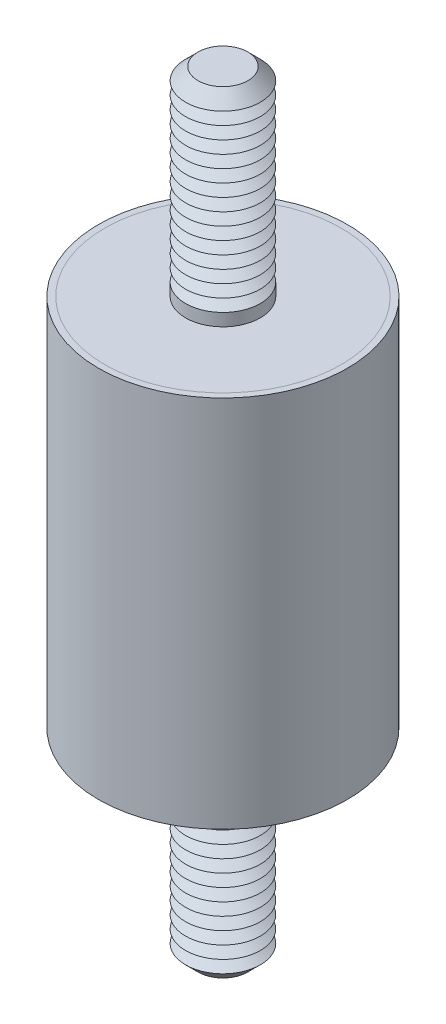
ISO-10303-21;
HEADER;
FILE_DESCRIPTION(('STEP AP214'),'2;1');
FILE_NAME('part.step','',(''),(''),'','','');
FILE_SCHEMA(('AUTOMOTIVE_DESIGN { 1 0 10303 214 1 1 1 1 }'));
ENDSEC;
DATA;
#1=APPLICATION_CONTEXT('core data for automotive mechanical design processes');
#2=APPLICATION_PROTOCOL_DEFINITION('international standard','automotive_design',2000,#1);
#3=PRODUCT_CONTEXT('',#1,'mechanical');
#4=PRODUCT('Part','Part','',(#3));
#5=PRODUCT_RELATED_PRODUCT_CATEGORY('part','',(#4));
#6=PRODUCT_DEFINITION_FORMATION('','',#4);
#7=PRODUCT_DEFINITION_CONTEXT('part definition',#1,'design');
#8=PRODUCT_DEFINITION('design','',#6,#7);
#9=PRODUCT_DEFINITION_SHAPE('','',#8);
#10=(LENGTH_UNIT() NAMED_UNIT(*) SI_UNIT(.MILLI.,.METRE.));
#11=(NAMED_UNIT(*) PLANE_ANGLE_UNIT() SI_UNIT($,.RADIAN.));
#12=(NAMED_UNIT(*) SI_UNIT($,.STERADIAN.) SOLID_ANGLE_UNIT());
#13=UNCERTAINTY_MEASURE_WITH_UNIT(LENGTH_MEASURE(1.E-05),#10,'distance_accuracy_value','');
#14=(GEOMETRIC_REPRESENTATION_CONTEXT(3) GLOBAL_UNCERTAINTY_ASSIGNED_CONTEXT((#13)) GLOBAL_UNIT_ASSIGNED_CONTEXT((#10,
#11,#12)) REPRESENTATION_CONTEXT('',''));
#15=CARTESIAN_POINT('',(0.,0.,0.));
#16=DIRECTION('',(0.,0.,1.));
#17=DIRECTION('',(1.,0.,0.));
#18=AXIS2_PLACEMENT_3D('',#15,#16,#17);
#19=CARTESIAN_POINT('',(0.,-31.,0.));
#20=DIRECTION('',(0.,1.,0.));
#21=DIRECTION('',(0.,0.,1.));
#22=AXIS2_PLACEMENT_3D('',#19,#20,#21);
#23=CYLINDRICAL_SURFACE('',#22,3.);
#24=CARTESIAN_POINT('',(0.,-15.,0.));
#25=DIRECTION('',(0.,-1.,0.));
#26=DIRECTION('',(0.,0.,-1.));
#27=AXIS2_PLACEMENT_3D('',#24,#25,#26);
#28=CIRCLE('',#27,3.);
#29=CARTESIAN_POINT('',(0.,-15.,-3.));
#30=VERTEX_POINT('',#29);
#31=EDGE_CURVE('P0_E21',#30,#30,#28,.T.);
#32=ORIENTED_EDGE('',*,*,#31,.T.);
#33=EDGE_LOOP('',(#32));
#34=FACE_BOUND('',#33,.T.);
#35=CARTESIAN_POINT('',(0.,-16.,0.));
#36=DIRECTION('',(0.,1.,0.));
#37=DIRECTION('',(0.,0.,1.));
#38=AXIS2_PLACEMENT_3D('',#35,#36,#37);
#39=CIRCLE('',#38,3.);
#40=CARTESIAN_POINT('',(0.,-16.,3.));
#41=VERTEX_POINT('',#40);
#42=EDGE_CURVE('P0_E33',#41,#41,#39,.T.);
#43=ORIENTED_EDGE('',*,*,#42,.T.);
#44=EDGE_LOOP('',(#43));
#45=FACE_BOUND('',#44,.T.);
#46=ADVANCED_FACE('P0_F14',(#34,#45),#23,.T.);
#47=CARTESIAN_POINT('',(0.,-15.,0.));
#48=DIRECTION('',(0.,1.,0.));
#49=DIRECTION('',(0.,0.,1.));
#50=AXIS2_PLACEMENT_3D('',#47,#48,#49);
#51=CYLINDRICAL_SURFACE('',#50,9.5);
#52=CARTESIAN_POINT('',(0.,-15.,0.));
#53=DIRECTION('',(0.,1.,0.));
#54=DIRECTION('',(0.,0.,1.));
#55=AXIS2_PLACEMENT_3D('',#52,#53,#54);
#56=CIRCLE('',#55,9.5);
#57=CARTESIAN_POINT('',(0.,-15.,9.5));
#58=VERTEX_POINT('',#57);
#59=EDGE_CURVE('P0_E25',#58,#58,#56,.T.);
#60=ORIENTED_EDGE('',*,*,#59,.T.);
#61=EDGE_LOOP('',(#60));
#62=FACE_BOUND('',#61,.T.);
#63=CARTESIAN_POINT('',(0.,-14.,0.));
#64=DIRECTION('',(0.,1.,0.));
#65=DIRECTION('',(0.,0.,1.));
#66=AXIS2_PLACEMENT_3D('',#63,#64,#65);
#67=CIRCLE('',#66,9.5);
#68=CARTESIAN_POINT('',(0.,-14.,9.5));
#69=VERTEX_POINT('',#68);
#70=EDGE_CURVE('P0_E30',#69,#69,#67,.T.);
#71=ORIENTED_EDGE('',*,*,#70,.F.);
#72=EDGE_LOOP('',(#71));
#73=FACE_BOUND('',#72,.T.);
#74=ADVANCED_FACE('P0_F145',(#62,#73),#51,.T.);
#75=CARTESIAN_POINT('',(0.,-15.,0.));
#76=DIRECTION('',(0.,1.,0.));
#77=DIRECTION('',(0.,0.,1.));
#78=AXIS2_PLACEMENT_3D('',#75,#76,#77);
#79=PLANE('',#78);
#80=ORIENTED_EDGE('',*,*,#31,.F.);
#81=EDGE_LOOP('',(#80));
#82=FACE_BOUND('',#81,.T.);
#83=ORIENTED_EDGE('',*,*,#59,.F.);
#84=EDGE_LOOP('',(#83));
#85=FACE_BOUND('',#84,.T.);
#86=ADVANCED_FACE('P0_F150',(#82,#85),#79,.F.);
#87=CARTESIAN_POINT('',(0.,-14.,0.));
#88=DIRECTION('',(0.,1.,0.));
#89=DIRECTION('',(0.,0.,1.));
#90=AXIS2_PLACEMENT_3D('',#87,#88,#89);
#91=PLANE('',#90);
#92=ORIENTED_EDGE('',*,*,#70,.T.);
#93=EDGE_LOOP('',(#92));
#94=FACE_BOUND('',#93,.T.);
#95=ADVANCED_FACE('P0_F156',(#94),#91,.T.);
#96=CARTESIAN_POINT('',(0.,-16.,0.));
#97=DIRECTION('',(0.,1.,0.));
#98=DIRECTION('',(0.,0.,1.));
#99=AXIS2_PLACEMENT_3D('',#96,#97,#98);
#100=CONICAL_SURFACE('',#99,3.,1.0471975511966);
#101=CARTESIAN_POINT('',(0.,-16.5,0.));
#102=DIRECTION('',(0.,1.,0.));
#103=DIRECTION('',(0.,0.,1.));
#104=AXIS2_PLACEMENT_3D('',#101,#102,#103);
#105=CIRCLE('',#104,2.13397459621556);
#106=CARTESIAN_POINT('',(0.,-16.5,2.13397459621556));
#107=VERTEX_POINT('',#106);
#108=EDGE_CURVE('P0_E39',#107,#107,#105,.T.);
#109=ORIENTED_EDGE('',*,*,#108,.T.);
#110=EDGE_LOOP('',(#109));
#111=FACE_BOUND('',#110,.T.);
#112=ORIENTED_EDGE('',*,*,#42,.F.);
#113=EDGE_LOOP('',(#112));
#114=FACE_BOUND('',#113,.T.);
#115=ADVANCED_FACE('P0_F159',(#111,#114),#100,.T.);
#116=CARTESIAN_POINT('',(0.,-16.5,0.));
#117=DIRECTION('',(0.,-1.,0.));
#118=DIRECTION('',(0.,0.,-1.));
#119=AXIS2_PLACEMENT_3D('',#116,#117,#118);
#120=CONICAL_SURFACE('',#119,2.13397459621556,1.0471975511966);
#121=CARTESIAN_POINT('',(0.,-17.,0.));
#122=DIRECTION('',(0.,1.,0.));
#123=DIRECTION('',(0.,0.,1.));
#124=AXIS2_PLACEMENT_3D('',#121,#122,#123);
#125=CIRCLE('',#124,3.);
#126=CARTESIAN_POINT('',(0.,-17.,3.));
#127=VERTEX_POINT('',#126);
#128=EDGE_CURVE('P0_E43',#127,#127,#125,.T.);
#129=ORIENTED_EDGE('',*,*,#128,.T.);
#130=EDGE_LOOP('',(#129));
#131=FACE_BOUND('',#130,.T.);
#132=ORIENTED_EDGE('',*,*,#108,.F.);
#133=EDGE_LOOP('',(#132));
#134=FACE_BOUND('',#133,.T.);
#135=ADVANCED_FACE('P0_F163',(#131,#134),#120,.T.);
#136=CARTESIAN_POINT('',(0.,-17.,0.));
#137=DIRECTION('',(0.,1.,0.));
#138=DIRECTION('',(0.,0.,1.));
#139=AXIS2_PLACEMENT_3D('',#136,#137,#138);
#140=CONICAL_SURFACE('',#139,3.,1.0471975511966);
#141=CARTESIAN_POINT('',(0.,-17.5,0.));
#142=DIRECTION('',(0.,1.,0.));
#143=DIRECTION('',(0.,0.,1.));
#144=AXIS2_PLACEMENT_3D('',#141,#142,#143);
#145=CIRCLE('',#144,2.13397459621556);
#146=CARTESIAN_POINT('',(0.,-17.5,2.13397459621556));
#147=VERTEX_POINT('',#146);
#148=EDGE_CURVE('P0_E47',#147,#147,#145,.T.);
#149=ORIENTED_EDGE('',*,*,#148,.T.);
#150=EDGE_LOOP('',(#149));
#151=FACE_BOUND('',#150,.T.);
#152=ORIENTED_EDGE('',*,*,#128,.F.);
#153=EDGE_LOOP('',(#152));
#154=FACE_BOUND('',#153,.T.);
#155=ADVANCED_FACE('P0_F167',(#151,#154),#140,.T.);
#156=CARTESIAN_POINT('',(0.,-17.5,0.));
#157=DIRECTION('',(0.,-1.,0.));
#158=DIRECTION('',(0.,0.,-1.));
#159=AXIS2_PLACEMENT_3D('',#156,#157,#158);
#160=CONICAL_SURFACE('',#159,2.13397459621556,1.0471975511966);
#161=CARTESIAN_POINT('',(0.,-18.,0.));
#162=DIRECTION('',(0.,1.,0.));
#163=DIRECTION('',(0.,0.,1.));
#164=AXIS2_PLACEMENT_3D('',#161,#162,#163);
#165=CIRCLE('',#164,3.);
#166=CARTESIAN_POINT('',(0.,-18.,3.));
#167=VERTEX_POINT('',#166);
#168=EDGE_CURVE('P0_E52',#167,#167,#165,.T.);
#169=ORIENTED_EDGE('',*,*,#168,.T.);
#170=EDGE_LOOP('',(#169));
#171=FACE_BOUND('',#170,.T.);
#172=ORIENTED_EDGE('',*,*,#148,.F.);
#173=EDGE_LOOP('',(#172));
#174=FACE_BOUND('',#173,.T.);
#175=ADVANCED_FACE('P0_F174',(#171,#174),#160,.T.);
#176=CARTESIAN_POINT('',(0.,-18.,0.));
#177=DIRECTION('',(0.,1.,0.));
#178=DIRECTION('',(0.,0.,1.));
#179=AXIS2_PLACEMENT_3D('',#176,#177,#178);
#180=CONICAL_SURFACE('',#179,3.,1.0471975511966);
#181=CARTESIAN_POINT('',(0.,-18.5,0.));
#182=DIRECTION('',(0.,1.,0.));
#183=DIRECTION('',(0.,0.,1.));
#184=AXIS2_PLACEMENT_3D('',#181,#182,#183);
#185=CIRCLE('',#184,2.13397459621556);
#186=CARTESIAN_POINT('',(0.,-18.5,2.13397459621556));
#187=VERTEX_POINT('',#186);
#188=EDGE_CURVE('P0_E55',#187,#187,#185,.T.);
#189=ORIENTED_EDGE('',*,*,#188,.T.);
#190=EDGE_LOOP('',(#189));
#191=FACE_BOUND('',#190,.T.);
#192=ORIENTED_EDGE('',*,*,#168,.F.);
#193=EDGE_LOOP('',(#192));
#194=FACE_BOUND('',#193,.T.);
#195=ADVANCED_FACE('P0_F178',(#191,#194),#180,.T.);
#196=CARTESIAN_POINT('',(0.,-18.5,0.));
#197=DIRECTION('',(0.,-1.,0.));
#198=DIRECTION('',(0.,0.,-1.));
#199=AXIS2_PLACEMENT_3D('',#196,#197,#198);
#200=CONICAL_SURFACE('',#199,2.13397459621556,1.0471975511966);
#201=CARTESIAN_POINT('',(0.,-19.,0.));
#202=DIRECTION('',(0.,1.,0.));
#203=DIRECTION('',(0.,0.,1.));
#204=AXIS2_PLACEMENT_3D('',#201,#202,#203);
#205=CIRCLE('',#204,3.);
#206=CARTESIAN_POINT('',(0.,-19.,3.));
#207=VERTEX_POINT('',#206);
#208=EDGE_CURVE('P0_E58',#207,#207,#205,.T.);
#209=ORIENTED_EDGE('',*,*,#208,.T.);
#210=EDGE_LOOP('',(#209));
#211=FACE_BOUND('',#210,.T.);
#212=ORIENTED_EDGE('',*,*,#188,.F.);
#213=EDGE_LOOP('',(#212));
#214=FACE_BOUND('',#213,.T.);
#215=ADVANCED_FACE('P0_F182',(#211,#214),#200,.T.);
#216=CARTESIAN_POINT('',(0.,-19.,0.));
#217=DIRECTION('',(0.,1.,0.));
#218=DIRECTION('',(0.,0.,1.));
#219=AXIS2_PLACEMENT_3D('',#216,#217,#218);
#220=CONICAL_SURFACE('',#219,3.,1.0471975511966);
#221=CARTESIAN_POINT('',(0.,-19.5,0.));
#222=DIRECTION('',(0.,1.,0.));
#223=DIRECTION('',(0.,0.,1.));
#224=AXIS2_PLACEMENT_3D('',#221,#222,#223);
#225=CIRCLE('',#224,2.13397459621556);
#226=CARTESIAN_POINT('',(0.,-19.5,2.13397459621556));
#227=VERTEX_POINT('',#226);
#228=EDGE_CURVE('P0_E61',#227,#227,#225,.T.);
#229=ORIENTED_EDGE('',*,*,#228,.T.);
#230=EDGE_LOOP('',(#229));
#231=FACE_BOUND('',#230,.T.);
#232=ORIENTED_EDGE('',*,*,#208,.F.);
#233=EDGE_LOOP('',(#232));
#234=FACE_BOUND('',#233,.T.);
#235=ADVANCED_FACE('P0_F186',(#231,#234),#220,.T.);
#236=CARTESIAN_POINT('',(0.,-19.5,0.));
#237=DIRECTION('',(0.,-1.,0.));
#238=DIRECTION('',(0.,0.,-1.));
#239=AXIS2_PLACEMENT_3D('',#236,#237,#238);
#240=CONICAL_SURFACE('',#239,2.13397459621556,1.0471975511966);
#241=CARTESIAN_POINT('',(0.,-20.,0.));
#242=DIRECTION('',(0.,1.,0.));
#243=DIRECTION('',(0.,0.,1.));
#244=AXIS2_PLACEMENT_3D('',#241,#242,#243);
#245=CIRCLE('',#244,3.);
#246=CARTESIAN_POINT('',(0.,-20.,3.));
#247=VERTEX_POINT('',#246);
#248=EDGE_CURVE('P0_E64',#247,#247,#245,.T.);
#249=ORIENTED_EDGE('',*,*,#248,.T.);
#250=EDGE_LOOP('',(#249));
#251=FACE_BOUND('',#250,.T.);
#252=ORIENTED_EDGE('',*,*,#228,.F.);
#253=EDGE_LOOP('',(#252));
#254=FACE_BOUND('',#253,.T.);
#255=ADVANCED_FACE('P0_F190',(#251,#254),#240,.T.);
#256=CARTESIAN_POINT('',(0.,-20.,0.));
#257=DIRECTION('',(0.,1.,0.));
#258=DIRECTION('',(0.,0.,1.));
#259=AXIS2_PLACEMENT_3D('',#256,#257,#258);
#260=CONICAL_SURFACE('',#259,3.,1.0471975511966);
#261=CARTESIAN_POINT('',(0.,-20.5,0.));
#262=DIRECTION('',(0.,1.,0.));
#263=DIRECTION('',(0.,0.,1.));
#264=AXIS2_PLACEMENT_3D('',#261,#262,#263);
#265=CIRCLE('',#264,2.13397459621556);
#266=CARTESIAN_POINT('',(0.,-20.5,2.13397459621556));
#267=VERTEX_POINT('',#266);
#268=EDGE_CURVE('P0_E67',#267,#267,#265,.T.);
#269=ORIENTED_EDGE('',*,*,#268,.T.);
#270=EDGE_LOOP('',(#269));
#271=FACE_BOUND('',#270,.T.);
#272=ORIENTED_EDGE('',*,*,#248,.F.);
#273=EDGE_LOOP('',(#272));
#274=FACE_BOUND('',#273,.T.);
#275=ADVANCED_FACE('P0_F194',(#271,#274),#260,.T.);
#276=CARTESIAN_POINT('',(0.,-20.5,0.));
#277=DIRECTION('',(0.,-1.,0.));
#278=DIRECTION('',(0.,0.,-1.));
#279=AXIS2_PLACEMENT_3D('',#276,#277,#278);
#280=CONICAL_SURFACE('',#279,2.13397459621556,1.0471975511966);
#281=CARTESIAN_POINT('',(0.,-21.,0.));
#282=DIRECTION('',(0.,1.,0.));
#283=DIRECTION('',(0.,0.,1.));
#284=AXIS2_PLACEMENT_3D('',#281,#282,#283);
#285=CIRCLE('',#284,3.);
#286=CARTESIAN_POINT('',(0.,-21.,3.));
#287=VERTEX_POINT('',#286);
#288=EDGE_CURVE('P0_E70',#287,#287,#285,.T.);
#289=ORIENTED_EDGE('',*,*,#288,.T.);
#290=EDGE_LOOP('',(#289));
#291=FACE_BOUND('',#290,.T.);
#292=ORIENTED_EDGE('',*,*,#268,.F.);
#293=EDGE_LOOP('',(#292));
#294=FACE_BOUND('',#293,.T.);
#295=ADVANCED_FACE('P0_F198',(#291,#294),#280,.T.);
#296=CARTESIAN_POINT('',(0.,-21.,0.));
#297=DIRECTION('',(0.,1.,0.));
#298=DIRECTION('',(0.,0.,1.));
#299=AXIS2_PLACEMENT_3D('',#296,#297,#298);
#300=CONICAL_SURFACE('',#299,3.,1.0471975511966);
#301=CARTESIAN_POINT('',(0.,-21.5,0.));
#302=DIRECTION('',(0.,1.,0.));
#303=DIRECTION('',(0.,0.,1.));
#304=AXIS2_PLACEMENT_3D('',#301,#302,#303);
#305=CIRCLE('',#304,2.13397459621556);
#306=CARTESIAN_POINT('',(0.,-21.5,2.13397459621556));
#307=VERTEX_POINT('',#306);
#308=EDGE_CURVE('P0_E73',#307,#307,#305,.T.);
#309=ORIENTED_EDGE('',*,*,#308,.T.);
#310=EDGE_LOOP('',(#309));
#311=FACE_BOUND('',#310,.T.);
#312=ORIENTED_EDGE('',*,*,#288,.F.);
#313=EDGE_LOOP('',(#312));
#314=FACE_BOUND('',#313,.T.);
#315=ADVANCED_FACE('P0_F202',(#311,#314),#300,.T.);
#316=CARTESIAN_POINT('',(0.,-21.5,0.));
#317=DIRECTION('',(0.,-1.,0.));
#318=DIRECTION('',(0.,0.,-1.));
#319=AXIS2_PLACEMENT_3D('',#316,#317,#318);
#320=CONICAL_SURFACE('',#319,2.13397459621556,1.0471975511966);
#321=CARTESIAN_POINT('',(0.,-22.,0.));
#322=DIRECTION('',(0.,1.,0.));
#323=DIRECTION('',(0.,0.,1.));
#324=AXIS2_PLACEMENT_3D('',#321,#322,#323);
#325=CIRCLE('',#324,3.);
#326=CARTESIAN_POINT('',(0.,-22.,3.));
#327=VERTEX_POINT('',#326);
#328=EDGE_CURVE('P0_E76',#327,#327,#325,.T.);
#329=ORIENTED_EDGE('',*,*,#328,.T.);
#330=EDGE_LOOP('',(#329));
#331=FACE_BOUND('',#330,.T.);
#332=ORIENTED_EDGE('',*,*,#308,.F.);
#333=EDGE_LOOP('',(#332));
#334=FACE_BOUND('',#333,.T.);
#335=ADVANCED_FACE('P0_F206',(#331,#334),#320,.T.);
#336=CARTESIAN_POINT('',(0.,-22.,0.));
#337=DIRECTION('',(0.,1.,0.));
#338=DIRECTION('',(0.,0.,1.));
#339=AXIS2_PLACEMENT_3D('',#336,#337,#338);
#340=CONICAL_SURFACE('',#339,3.,1.0471975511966);
#341=CARTESIAN_POINT('',(0.,-22.5,0.));
#342=DIRECTION('',(0.,1.,0.));
#343=DIRECTION('',(0.,0.,1.));
#344=AXIS2_PLACEMENT_3D('',#341,#342,#343);
#345=CIRCLE('',#344,2.13397459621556);
#346=CARTESIAN_POINT('',(0.,-22.5,2.13397459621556));
#347=VERTEX_POINT('',#346);
#348=EDGE_CURVE('P0_E79',#347,#347,#345,.T.);
#349=ORIENTED_EDGE('',*,*,#348,.T.);
#350=EDGE_LOOP('',(#349));
#351=FACE_BOUND('',#350,.T.);
#352=ORIENTED_EDGE('',*,*,#328,.F.);
#353=EDGE_LOOP('',(#352));
#354=FACE_BOUND('',#353,.T.);
#355=ADVANCED_FACE('P0_F210',(#351,#354),#340,.T.);
#356=CARTESIAN_POINT('',(0.,-22.5,0.));
#357=DIRECTION('',(0.,-1.,0.));
#358=DIRECTION('',(0.,0.,-1.));
#359=AXIS2_PLACEMENT_3D('',#356,#357,#358);
#360=CONICAL_SURFACE('',#359,2.13397459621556,1.0471975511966);
#361=CARTESIAN_POINT('',(0.,-23.,0.));
#362=DIRECTION('',(0.,1.,0.));
#363=DIRECTION('',(0.,0.,1.));
#364=AXIS2_PLACEMENT_3D('',#361,#362,#363);
#365=CIRCLE('',#364,3.);
#366=CARTESIAN_POINT('',(0.,-23.,3.));
#367=VERTEX_POINT('',#366);
#368=EDGE_CURVE('P0_E82',#367,#367,#365,.T.);
#369=ORIENTED_EDGE('',*,*,#368,.T.);
#370=EDGE_LOOP('',(#369));
#371=FACE_BOUND('',#370,.T.);
#372=ORIENTED_EDGE('',*,*,#348,.F.);
#373=EDGE_LOOP('',(#372));
#374=FACE_BOUND('',#373,.T.);
#375=ADVANCED_FACE('P0_F214',(#371,#374),#360,.T.);
#376=CARTESIAN_POINT('',(0.,-23.,0.));
#377=DIRECTION('',(0.,1.,0.));
#378=DIRECTION('',(0.,0.,1.));
#379=AXIS2_PLACEMENT_3D('',#376,#377,#378);
#380=CONICAL_SURFACE('',#379,3.,1.0471975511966);
#381=CARTESIAN_POINT('',(0.,-23.5,0.));
#382=DIRECTION('',(0.,1.,0.));
#383=DIRECTION('',(0.,0.,1.));
#384=AXIS2_PLACEMENT_3D('',#381,#382,#383);
#385=CIRCLE('',#384,2.13397459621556);
#386=CARTESIAN_POINT('',(0.,-23.5,2.13397459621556));
#387=VERTEX_POINT('',#386);
#388=EDGE_CURVE('P0_E85',#387,#387,#385,.T.);
#389=ORIENTED_EDGE('',*,*,#388,.T.);
#390=EDGE_LOOP('',(#389));
#391=FACE_BOUND('',#390,.T.);
#392=ORIENTED_EDGE('',*,*,#368,.F.);
#393=EDGE_LOOP('',(#392));
#394=FACE_BOUND('',#393,.T.);
#395=ADVANCED_FACE('P0_F218',(#391,#394),#380,.T.);
#396=CARTESIAN_POINT('',(0.,-23.5,0.));
#397=DIRECTION('',(0.,-1.,0.));
#398=DIRECTION('',(0.,0.,-1.));
#399=AXIS2_PLACEMENT_3D('',#396,#397,#398);
#400=CONICAL_SURFACE('',#399,2.13397459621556,1.0471975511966);
#401=CARTESIAN_POINT('',(0.,-24.,0.));
#402=DIRECTION('',(0.,1.,0.));
#403=DIRECTION('',(0.,0.,1.));
#404=AXIS2_PLACEMENT_3D('',#401,#402,#403);
#405=CIRCLE('',#404,3.);
#406=CARTESIAN_POINT('',(0.,-24.,3.));
#407=VERTEX_POINT('',#406);
#408=EDGE_CURVE('P0_E88',#407,#407,#405,.T.);
#409=ORIENTED_EDGE('',*,*,#408,.T.);
#410=EDGE_LOOP('',(#409));
#411=FACE_BOUND('',#410,.T.);
#412=ORIENTED_EDGE('',*,*,#388,.F.);
#413=EDGE_LOOP('',(#412));
#414=FACE_BOUND('',#413,.T.);
#415=ADVANCED_FACE('P0_F222',(#411,#414),#400,.T.);
#416=CARTESIAN_POINT('',(0.,-24.,0.));
#417=DIRECTION('',(0.,1.,0.));
#418=DIRECTION('',(0.,0.,1.));
#419=AXIS2_PLACEMENT_3D('',#416,#417,#418);
#420=CONICAL_SURFACE('',#419,3.,1.0471975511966);
#421=CARTESIAN_POINT('',(0.,-24.5,0.));
#422=DIRECTION('',(0.,1.,0.));
#423=DIRECTION('',(0.,0.,1.));
#424=AXIS2_PLACEMENT_3D('',#421,#422,#423);
#425=CIRCLE('',#424,2.13397459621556);
#426=CARTESIAN_POINT('',(0.,-24.5,2.13397459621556));
#427=VERTEX_POINT('',#426);
#428=EDGE_CURVE('P0_E91',#427,#427,#425,.T.);
#429=ORIENTED_EDGE('',*,*,#428,.T.);
#430=EDGE_LOOP('',(#429));
#431=FACE_BOUND('',#430,.T.);
#432=ORIENTED_EDGE('',*,*,#408,.F.);
#433=EDGE_LOOP('',(#432));
#434=FACE_BOUND('',#433,.T.);
#435=ADVANCED_FACE('P0_F226',(#431,#434),#420,.T.);
#436=CARTESIAN_POINT('',(0.,-24.5,0.));
#437=DIRECTION('',(0.,-1.,0.));
#438=DIRECTION('',(0.,0.,-1.));
#439=AXIS2_PLACEMENT_3D('',#436,#437,#438);
#440=CONICAL_SURFACE('',#439,2.13397459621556,1.0471975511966);
#441=CARTESIAN_POINT('',(0.,-25.,0.));
#442=DIRECTION('',(0.,1.,0.));
#443=DIRECTION('',(0.,0.,1.));
#444=AXIS2_PLACEMENT_3D('',#441,#442,#443);
#445=CIRCLE('',#444,3.);
#446=CARTESIAN_POINT('',(0.,-25.,3.));
#447=VERTEX_POINT('',#446);
#448=EDGE_CURVE('P0_E94',#447,#447,#445,.T.);
#449=ORIENTED_EDGE('',*,*,#448,.T.);
#450=EDGE_LOOP('',(#449));
#451=FACE_BOUND('',#450,.T.);
#452=ORIENTED_EDGE('',*,*,#428,.F.);
#453=EDGE_LOOP('',(#452));
#454=FACE_BOUND('',#453,.T.);
#455=ADVANCED_FACE('P0_F230',(#451,#454),#440,.T.);
#456=CARTESIAN_POINT('',(0.,-25.,0.));
#457=DIRECTION('',(0.,1.,0.));
#458=DIRECTION('',(0.,0.,1.));
#459=AXIS2_PLACEMENT_3D('',#456,#457,#458);
#460=CONICAL_SURFACE('',#459,3.,1.0471975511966);
#461=CARTESIAN_POINT('',(0.,-25.5,0.));
#462=DIRECTION('',(0.,1.,0.));
#463=DIRECTION('',(0.,0.,1.));
#464=AXIS2_PLACEMENT_3D('',#461,#462,#463);
#465=CIRCLE('',#464,2.13397459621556);
#466=CARTESIAN_POINT('',(0.,-25.5,2.13397459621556));
#467=VERTEX_POINT('',#466);
#468=EDGE_CURVE('P0_E97',#467,#467,#465,.T.);
#469=ORIENTED_EDGE('',*,*,#468,.T.);
#470=EDGE_LOOP('',(#469));
#471=FACE_BOUND('',#470,.T.);
#472=ORIENTED_EDGE('',*,*,#448,.F.);
#473=EDGE_LOOP('',(#472));
#474=FACE_BOUND('',#473,.T.);
#475=ADVANCED_FACE('P0_F234',(#471,#474),#460,.T.);
#476=CARTESIAN_POINT('',(0.,-25.5,0.));
#477=DIRECTION('',(0.,-1.,0.));
#478=DIRECTION('',(0.,0.,-1.));
#479=AXIS2_PLACEMENT_3D('',#476,#477,#478);
#480=CONICAL_SURFACE('',#479,2.13397459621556,1.0471975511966);
#481=CARTESIAN_POINT('',(0.,-26.,0.));
#482=DIRECTION('',(0.,1.,0.));
#483=DIRECTION('',(0.,0.,1.));
#484=AXIS2_PLACEMENT_3D('',#481,#482,#483);
#485=CIRCLE('',#484,3.);
#486=CARTESIAN_POINT('',(0.,-26.,3.));
#487=VERTEX_POINT('',#486);
#488=EDGE_CURVE('P0_E100',#487,#487,#485,.T.);
#489=ORIENTED_EDGE('',*,*,#488,.T.);
#490=EDGE_LOOP('',(#489));
#491=FACE_BOUND('',#490,.T.);
#492=ORIENTED_EDGE('',*,*,#468,.F.);
#493=EDGE_LOOP('',(#492));
#494=FACE_BOUND('',#493,.T.);
#495=ADVANCED_FACE('P0_F238',(#491,#494),#480,.T.);
#496=CARTESIAN_POINT('',(0.,-26.,0.));
#497=DIRECTION('',(0.,1.,0.));
#498=DIRECTION('',(0.,0.,1.));
#499=AXIS2_PLACEMENT_3D('',#496,#497,#498);
#500=CONICAL_SURFACE('',#499,3.,1.0471975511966);
#501=CARTESIAN_POINT('',(0.,-26.5,0.));
#502=DIRECTION('',(0.,1.,0.));
#503=DIRECTION('',(0.,0.,1.));
#504=AXIS2_PLACEMENT_3D('',#501,#502,#503);
#505=CIRCLE('',#504,2.13397459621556);
#506=CARTESIAN_POINT('',(0.,-26.5,2.13397459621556));
#507=VERTEX_POINT('',#506);
#508=EDGE_CURVE('P0_E103',#507,#507,#505,.T.);
#509=ORIENTED_EDGE('',*,*,#508,.T.);
#510=EDGE_LOOP('',(#509));
#511=FACE_BOUND('',#510,.T.);
#512=ORIENTED_EDGE('',*,*,#488,.F.);
#513=EDGE_LOOP('',(#512));
#514=FACE_BOUND('',#513,.T.);
#515=ADVANCED_FACE('P0_F242',(#511,#514),#500,.T.);
#516=CARTESIAN_POINT('',(0.,-26.5,0.));
#517=DIRECTION('',(0.,-1.,0.));
#518=DIRECTION('',(0.,0.,-1.));
#519=AXIS2_PLACEMENT_3D('',#516,#517,#518);
#520=CONICAL_SURFACE('',#519,2.13397459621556,1.0471975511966);
#521=CARTESIAN_POINT('',(0.,-27.,0.));
#522=DIRECTION('',(0.,1.,0.));
#523=DIRECTION('',(0.,0.,1.));
#524=AXIS2_PLACEMENT_3D('',#521,#522,#523);
#525=CIRCLE('',#524,3.);
#526=CARTESIAN_POINT('',(0.,-27.,3.));
#527=VERTEX_POINT('',#526);
#528=EDGE_CURVE('P0_E106',#527,#527,#525,.T.);
#529=ORIENTED_EDGE('',*,*,#528,.T.);
#530=EDGE_LOOP('',(#529));
#531=FACE_BOUND('',#530,.T.);
#532=ORIENTED_EDGE('',*,*,#508,.F.);
#533=EDGE_LOOP('',(#532));
#534=FACE_BOUND('',#533,.T.);
#535=ADVANCED_FACE('P0_F246',(#531,#534),#520,.T.);
#536=CARTESIAN_POINT('',(0.,-27.,0.));
#537=DIRECTION('',(0.,1.,0.));
#538=DIRECTION('',(0.,0.,1.));
#539=AXIS2_PLACEMENT_3D('',#536,#537,#538);
#540=CONICAL_SURFACE('',#539,3.,1.0471975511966);
#541=CARTESIAN_POINT('',(0.,-27.5,0.));
#542=DIRECTION('',(0.,1.,0.));
#543=DIRECTION('',(0.,0.,1.));
#544=AXIS2_PLACEMENT_3D('',#541,#542,#543);
#545=CIRCLE('',#544,2.13397459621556);
#546=CARTESIAN_POINT('',(0.,-27.5,2.13397459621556));
#547=VERTEX_POINT('',#546);
#548=EDGE_CURVE('P0_E109',#547,#547,#545,.T.);
#549=ORIENTED_EDGE('',*,*,#548,.T.);
#550=EDGE_LOOP('',(#549));
#551=FACE_BOUND('',#550,.T.);
#552=ORIENTED_EDGE('',*,*,#528,.F.);
#553=EDGE_LOOP('',(#552));
#554=FACE_BOUND('',#553,.T.);
#555=ADVANCED_FACE('P0_F250',(#551,#554),#540,.T.);
#556=CARTESIAN_POINT('',(0.,-27.5,0.));
#557=DIRECTION('',(0.,-1.,0.));
#558=DIRECTION('',(0.,0.,-1.));
#559=AXIS2_PLACEMENT_3D('',#556,#557,#558);
#560=CONICAL_SURFACE('',#559,2.13397459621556,1.0471975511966);
#561=CARTESIAN_POINT('',(0.,-28.,0.));
#562=DIRECTION('',(0.,1.,0.));
#563=DIRECTION('',(0.,0.,1.));
#564=AXIS2_PLACEMENT_3D('',#561,#562,#563);
#565=CIRCLE('',#564,3.);
#566=CARTESIAN_POINT('',(0.,-28.,3.));
#567=VERTEX_POINT('',#566);
#568=EDGE_CURVE('P0_E112',#567,#567,#565,.T.);
#569=ORIENTED_EDGE('',*,*,#568,.T.);
#570=EDGE_LOOP('',(#569));
#571=FACE_BOUND('',#570,.T.);
#572=ORIENTED_EDGE('',*,*,#548,.F.);
#573=EDGE_LOOP('',(#572));
#574=FACE_BOUND('',#573,.T.);
#575=ADVANCED_FACE('P0_F254',(#571,#574),#560,.T.);
#576=CARTESIAN_POINT('',(0.,-28.,0.));
#577=DIRECTION('',(0.,1.,0.));
#578=DIRECTION('',(0.,0.,1.));
#579=AXIS2_PLACEMENT_3D('',#576,#577,#578);
#580=CONICAL_SURFACE('',#579,3.,1.0471975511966);
#581=CARTESIAN_POINT('',(0.,-28.5,0.));
#582=DIRECTION('',(0.,1.,0.));
#583=DIRECTION('',(0.,0.,1.));
#584=AXIS2_PLACEMENT_3D('',#581,#582,#583);
#585=CIRCLE('',#584,2.13397459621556);
#586=CARTESIAN_POINT('',(0.,-28.5,2.13397459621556));
#587=VERTEX_POINT('',#586);
#588=EDGE_CURVE('P0_E115',#587,#587,#585,.T.);
#589=ORIENTED_EDGE('',*,*,#588,.T.);
#590=EDGE_LOOP('',(#589));
#591=FACE_BOUND('',#590,.T.);
#592=ORIENTED_EDGE('',*,*,#568,.F.);
#593=EDGE_LOOP('',(#592));
#594=FACE_BOUND('',#593,.T.);
#595=ADVANCED_FACE('P0_F258',(#591,#594),#580,.T.);
#596=CARTESIAN_POINT('',(0.,-28.5,0.));
#597=DIRECTION('',(0.,-1.,0.));
#598=DIRECTION('',(0.,0.,-1.));
#599=AXIS2_PLACEMENT_3D('',#596,#597,#598);
#600=CONICAL_SURFACE('',#599,2.13397459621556,1.0471975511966);
#601=CARTESIAN_POINT('',(0.,-29.,0.));
#602=DIRECTION('',(0.,1.,0.));
#603=DIRECTION('',(0.,0.,1.));
#604=AXIS2_PLACEMENT_3D('',#601,#602,#603);
#605=CIRCLE('',#604,3.);
#606=CARTESIAN_POINT('',(0.,-29.,3.));
#607=VERTEX_POINT('',#606);
#608=EDGE_CURVE('P0_E118',#607,#607,#605,.T.);
#609=ORIENTED_EDGE('',*,*,#608,.T.);
#610=EDGE_LOOP('',(#609));
#611=FACE_BOUND('',#610,.T.);
#612=ORIENTED_EDGE('',*,*,#588,.F.);
#613=EDGE_LOOP('',(#612));
#614=FACE_BOUND('',#613,.T.);
#615=ADVANCED_FACE('P0_F142',(#611,#614),#600,.T.);
#616=CARTESIAN_POINT('',(0.,-29.,0.));
#617=DIRECTION('',(0.,1.,0.));
#618=DIRECTION('',(0.,0.,1.));
#619=AXIS2_PLACEMENT_3D('',#616,#617,#618);
#620=CONICAL_SURFACE('',#619,3.,1.0471975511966);
#621=CARTESIAN_POINT('',(0.,-29.5,0.));
#622=DIRECTION('',(0.,1.,0.));
#623=DIRECTION('',(0.,0.,1.));
#624=AXIS2_PLACEMENT_3D('',#621,#622,#623);
#625=CIRCLE('',#624,2.13397459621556);
#626=CARTESIAN_POINT('',(0.,-29.5,2.13397459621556));
#627=VERTEX_POINT('',#626);
#628=EDGE_CURVE('P0_E124',#627,#627,#625,.T.);
#629=ORIENTED_EDGE('',*,*,#628,.T.);
#630=EDGE_LOOP('',(#629));
#631=FACE_BOUND('',#630,.T.);
#632=ORIENTED_EDGE('',*,*,#608,.F.);
#633=EDGE_LOOP('',(#632));
#634=FACE_BOUND('',#633,.T.);
#635=ADVANCED_FACE('P0_F128',(#631,#634),#620,.T.);
#636=CARTESIAN_POINT('',(0.,-29.5,0.));
#637=DIRECTION('',(0.,-1.,0.));
#638=DIRECTION('',(0.,0.,-1.));
#639=AXIS2_PLACEMENT_3D('',#636,#637,#638);
#640=CONICAL_SURFACE('',#639,2.13397459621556,1.0471975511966);
#641=CARTESIAN_POINT('',(0.,-30.,0.));
#642=DIRECTION('',(0.,1.,0.));
#643=DIRECTION('',(0.,0.,1.));
#644=AXIS2_PLACEMENT_3D('',#641,#642,#643);
#645=CIRCLE('',#644,3.);
#646=CARTESIAN_POINT('',(0.,-30.,3.));
#647=VERTEX_POINT('',#646);
#648=EDGE_CURVE('P0_E121',#647,#647,#645,.T.);
#649=ORIENTED_EDGE('',*,*,#648,.T.);
#650=EDGE_LOOP('',(#649));
#651=FACE_BOUND('',#650,.T.);
#652=ORIENTED_EDGE('',*,*,#628,.F.);
#653=EDGE_LOOP('',(#652));
#654=FACE_BOUND('',#653,.T.);
#655=ADVANCED_FACE('P0_F131',(#651,#654),#640,.T.);
#656=CARTESIAN_POINT('',(0.,-31.,0.));
#657=DIRECTION('',(0.,-1.,0.));
#658=DIRECTION('',(0.,0.,-1.));
#659=AXIS2_PLACEMENT_3D('',#656,#657,#658);
#660=PLANE('',#659);
#661=CARTESIAN_POINT('',(0.,-31.,0.));
#662=DIRECTION('',(0.,-1.,0.));
#663=DIRECTION('',(0.,0.,-1.));
#664=AXIS2_PLACEMENT_3D('',#661,#662,#663);
#665=CIRCLE('',#664,2.);
#666=CARTESIAN_POINT('',(0.,-31.,-2.));
#667=VERTEX_POINT('',#666);
#668=EDGE_CURVE('P0_E10',#667,#667,#665,.T.);
#669=ORIENTED_EDGE('',*,*,#668,.T.);
#670=EDGE_LOOP('',(#669));
#671=FACE_BOUND('',#670,.T.);
#672=ADVANCED_FACE('P0_F133',(#671),#660,.T.);
#673=CARTESIAN_POINT('',(0.,-31.,0.));
#674=DIRECTION('',(0.,1.,0.));
#675=DIRECTION('',(0.,0.,1.));
#676=AXIS2_PLACEMENT_3D('',#673,#674,#675);
#677=CONICAL_SURFACE('',#676,2.,0.785398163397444);
#678=ORIENTED_EDGE('',*,*,#648,.F.);
#679=EDGE_LOOP('',(#678));
#680=FACE_BOUND('',#679,.T.);
#681=ORIENTED_EDGE('',*,*,#668,.F.);
#682=EDGE_LOOP('',(#681));
#683=FACE_BOUND('',#682,.T.);
#684=ADVANCED_FACE('P0_F16',(#680,#683),#677,.T.);
#685=CLOSED_SHELL('',(#46,#74,#86,#95,#115,#135,#155,#175,#195,#215,#235,#255,#275,#295,#315,
#335,#355,#375,#395,#415,#435,#455,#475,#495,#515,#535,#555,#575,#595,#615,#635,#655,#672,#684));
#686=MANIFOLD_SOLID_BREP('P0_B1',#685);
#687=CARTESIAN_POINT('',(0.,31.,0.));
#688=DIRECTION('',(0.,-1.,0.));
#689=DIRECTION('',(0.,0.,-1.));
#690=AXIS2_PLACEMENT_3D('',#687,#688,#689);
#691=CYLINDRICAL_SURFACE('',#690,3.);
#692=CARTESIAN_POINT('',(0.,16.,0.));
#693=DIRECTION('',(0.,1.,0.));
#694=DIRECTION('',(0.,0.,1.));
#695=AXIS2_PLACEMENT_3D('',#692,#693,#694);
#696=CIRCLE('',#695,3.);
#697=CARTESIAN_POINT('',(0.,16.,3.));
#698=VERTEX_POINT('',#697);
#699=EDGE_CURVE('P1_E33',#698,#698,#696,.T.);
#700=ORIENTED_EDGE('',*,*,#699,.F.);
#701=EDGE_LOOP('',(#700));
#702=FACE_BOUND('',#701,.T.);
#703=CARTESIAN_POINT('',(0.,15.,0.));
#704=DIRECTION('',(0.,1.,0.));
#705=DIRECTION('',(0.,0.,1.));
#706=AXIS2_PLACEMENT_3D('',#703,#704,#705);
#707=CIRCLE('',#706,3.);
#708=CARTESIAN_POINT('',(0.,15.,3.));
#709=VERTEX_POINT('',#708);
#710=EDGE_CURVE('P1_E21',#709,#709,#707,.T.);
#711=ORIENTED_EDGE('',*,*,#710,.T.);
#712=EDGE_LOOP('',(#711));
#713=FACE_BOUND('',#712,.T.);
#714=ADVANCED_FACE('P1_F14',(#702,#713),#691,.T.);
#715=CARTESIAN_POINT('',(0.,15.,0.));
#716=DIRECTION('',(0.,-1.,0.));
#717=DIRECTION('',(0.,0.,-1.));
#718=AXIS2_PLACEMENT_3D('',#715,#716,#717);
#719=CYLINDRICAL_SURFACE('',#718,9.5);
#720=CARTESIAN_POINT('',(0.,15.,0.));
#721=DIRECTION('',(0.,1.,0.));
#722=DIRECTION('',(0.,0.,1.));
#723=AXIS2_PLACEMENT_3D('',#720,#721,#722);
#724=CIRCLE('',#723,9.5);
#725=CARTESIAN_POINT('',(0.,15.,9.5));
#726=VERTEX_POINT('',#725);
#727=EDGE_CURVE('P1_E25',#726,#726,#724,.T.);
#728=ORIENTED_EDGE('',*,*,#727,.F.);
#729=EDGE_LOOP('',(#728));
#730=FACE_BOUND('',#729,.T.);
#731=CARTESIAN_POINT('',(0.,14.,0.));
#732=DIRECTION('',(0.,1.,0.));
#733=DIRECTION('',(0.,0.,1.));
#734=AXIS2_PLACEMENT_3D('',#731,#732,#733);
#735=CIRCLE('',#734,9.5);
#736=CARTESIAN_POINT('',(0.,14.,9.5));
#737=VERTEX_POINT('',#736);
#738=EDGE_CURVE('P1_E30',#737,#737,#735,.T.);
#739=ORIENTED_EDGE('',*,*,#738,.T.);
#740=EDGE_LOOP('',(#739));
#741=FACE_BOUND('',#740,.T.);
#742=ADVANCED_FACE('P1_F292',(#730,#741),#719,.T.);
#743=CARTESIAN_POINT('',(0.,15.,0.));
#744=DIRECTION('',(0.,1.,0.));
#745=DIRECTION('',(0.,0.,1.));
#746=AXIS2_PLACEMENT_3D('',#743,#744,#745);
#747=PLANE('',#746);
#748=ORIENTED_EDGE('',*,*,#710,.F.);
#749=EDGE_LOOP('',(#748));
#750=FACE_BOUND('',#749,.T.);
#751=ORIENTED_EDGE('',*,*,#727,.T.);
#752=EDGE_LOOP('',(#751));
#753=FACE_BOUND('',#752,.T.);
#754=ADVANCED_FACE('P1_F298',(#750,#753),#747,.T.);
#755=CARTESIAN_POINT('',(0.,14.,0.));
#756=DIRECTION('',(0.,1.,0.));
#757=DIRECTION('',(0.,0.,1.));
#758=AXIS2_PLACEMENT_3D('',#755,#756,#757);
#759=PLANE('',#758);
#760=ORIENTED_EDGE('',*,*,#738,.F.);
#761=EDGE_LOOP('',(#760));
#762=FACE_BOUND('',#761,.T.);
#763=ADVANCED_FACE('P1_F288',(#762),#759,.F.);
#764=CARTESIAN_POINT('',(0.,16.,0.));
#765=DIRECTION('',(0.,-1.,0.));
#766=DIRECTION('',(0.,0.,-1.));
#767=AXIS2_PLACEMENT_3D('',#764,#765,#766);
#768=CONICAL_SURFACE('',#767,3.,1.0471975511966);
#769=CARTESIAN_POINT('',(0.,16.5,0.));
#770=DIRECTION('',(0.,1.,0.));
#771=DIRECTION('',(0.,0.,1.));
#772=AXIS2_PLACEMENT_3D('',#769,#770,#771);
#773=CIRCLE('',#772,2.13397459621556);
#774=CARTESIAN_POINT('',(0.,16.5,2.13397459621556));
#775=VERTEX_POINT('',#774);
#776=EDGE_CURVE('P1_E39',#775,#775,#773,.T.);
#777=ORIENTED_EDGE('',*,*,#776,.F.);
#778=EDGE_LOOP('',(#777));
#779=FACE_BOUND('',#778,.T.);
#780=ORIENTED_EDGE('',*,*,#699,.T.);
#781=EDGE_LOOP('',(#780));
#782=FACE_BOUND('',#781,.T.);
#783=ADVANCED_FACE('P1_F282',(#779,#782),#768,.T.);
#784=CARTESIAN_POINT('',(0.,16.5,0.));
#785=DIRECTION('',(0.,1.,0.));
#786=DIRECTION('',(0.,0.,1.));
#787=AXIS2_PLACEMENT_3D('',#784,#785,#786);
#788=CONICAL_SURFACE('',#787,2.13397459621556,1.0471975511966);
#789=CARTESIAN_POINT('',(0.,17.,0.));
#790=DIRECTION('',(0.,1.,0.));
#791=DIRECTION('',(0.,0.,1.));
#792=AXIS2_PLACEMENT_3D('',#789,#790,#791);
#793=CIRCLE('',#792,3.);
#794=CARTESIAN_POINT('',(0.,17.,3.));
#795=VERTEX_POINT('',#794);
#796=EDGE_CURVE('P1_E43',#795,#795,#793,.T.);
#797=ORIENTED_EDGE('',*,*,#796,.F.);
#798=EDGE_LOOP('',(#797));
#799=FACE_BOUND('',#798,.T.);
#800=ORIENTED_EDGE('',*,*,#776,.T.);
#801=EDGE_LOOP('',(#800));
#802=FACE_BOUND('',#801,.T.);
#803=ADVANCED_FACE('P1_F277',(#799,#802),#788,.T.);
#804=CARTESIAN_POINT('',(0.,17.,0.));
#805=DIRECTION('',(0.,-1.,0.));
#806=DIRECTION('',(0.,0.,-1.));
#807=AXIS2_PLACEMENT_3D('',#804,#805,#806);
#808=CONICAL_SURFACE('',#807,3.,1.0471975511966);
#809=CARTESIAN_POINT('',(0.,17.5,0.));
#810=DIRECTION('',(0.,1.,0.));
#811=DIRECTION('',(0.,0.,1.));
#812=AXIS2_PLACEMENT_3D('',#809,#810,#811);
#813=CIRCLE('',#812,2.13397459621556);
#814=CARTESIAN_POINT('',(0.,17.5,2.13397459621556));
#815=VERTEX_POINT('',#814);
#816=EDGE_CURVE('P1_E47',#815,#815,#813,.T.);
#817=ORIENTED_EDGE('',*,*,#816,.F.);
#818=EDGE_LOOP('',(#817));
#819=FACE_BOUND('',#818,.T.);
#820=ORIENTED_EDGE('',*,*,#796,.T.);
#821=EDGE_LOOP('',(#820));
#822=FACE_BOUND('',#821,.T.);
#823=ADVANCED_FACE('P1_F271',(#819,#822),#808,.T.);
#824=CARTESIAN_POINT('',(0.,17.5,0.));
#825=DIRECTION('',(0.,1.,0.));
#826=DIRECTION('',(0.,0.,1.));
#827=AXIS2_PLACEMENT_3D('',#824,#825,#826);
#828=CONICAL_SURFACE('',#827,2.13397459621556,1.0471975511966);
#829=CARTESIAN_POINT('',(0.,18.,0.));
#830=DIRECTION('',(0.,1.,0.));
#831=DIRECTION('',(0.,0.,1.));
#832=AXIS2_PLACEMENT_3D('',#829,#830,#831);
#833=CIRCLE('',#832,3.);
#834=CARTESIAN_POINT('',(0.,18.,3.));
#835=VERTEX_POINT('',#834);
#836=EDGE_CURVE('P1_E52',#835,#835,#833,.T.);
#837=ORIENTED_EDGE('',*,*,#836,.F.);
#838=EDGE_LOOP('',(#837));
#839=FACE_BOUND('',#838,.T.);
#840=ORIENTED_EDGE('',*,*,#816,.T.);
#841=EDGE_LOOP('',(#840));
#842=FACE_BOUND('',#841,.T.);
#843=ADVANCED_FACE('P1_F265',(#839,#842),#828,.T.);
#844=CARTESIAN_POINT('',(0.,18.,0.));
#845=DIRECTION('',(0.,-1.,0.));
#846=DIRECTION('',(0.,0.,-1.));
#847=AXIS2_PLACEMENT_3D('',#844,#845,#846);
#848=CONICAL_SURFACE('',#847,3.,1.0471975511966);
#849=CARTESIAN_POINT('',(0.,18.5,0.));
#850=DIRECTION('',(0.,1.,0.));
#851=DIRECTION('',(0.,0.,1.));
#852=AXIS2_PLACEMENT_3D('',#849,#850,#851);
#853=CIRCLE('',#852,2.13397459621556);
#854=CARTESIAN_POINT('',(0.,18.5,2.13397459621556));
#855=VERTEX_POINT('',#854);
#856=EDGE_CURVE('P1_E55',#855,#855,#853,.T.);
#857=ORIENTED_EDGE('',*,*,#856,.F.);
#858=EDGE_LOOP('',(#857));
#859=FACE_BOUND('',#858,.T.);
#860=ORIENTED_EDGE('',*,*,#836,.T.);
#861=EDGE_LOOP('',(#860));
#862=FACE_BOUND('',#861,.T.);
#863=ADVANCED_FACE('P1_F259',(#859,#862),#848,.T.);
#864=CARTESIAN_POINT('',(0.,18.5,0.));
#865=DIRECTION('',(0.,1.,0.));
#866=DIRECTION('',(0.,0.,1.));
#867=AXIS2_PLACEMENT_3D('',#864,#865,#866);
#868=CONICAL_SURFACE('',#867,2.13397459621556,1.0471975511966);
#869=CARTESIAN_POINT('',(0.,19.,0.));
#870=DIRECTION('',(0.,1.,0.));
#871=DIRECTION('',(0.,0.,1.));
#872=AXIS2_PLACEMENT_3D('',#869,#870,#871);
#873=CIRCLE('',#872,3.);
#874=CARTESIAN_POINT('',(0.,19.,3.));
#875=VERTEX_POINT('',#874);
#876=EDGE_CURVE('P1_E58',#875,#875,#873,.T.);
#877=ORIENTED_EDGE('',*,*,#876,.F.);
#878=EDGE_LOOP('',(#877));
#879=FACE_BOUND('',#878,.T.);
#880=ORIENTED_EDGE('',*,*,#856,.T.);
#881=EDGE_LOOP('',(#880));
#882=FACE_BOUND('',#881,.T.);
#883=ADVANCED_FACE('P1_F253',(#879,#882),#868,.T.);
#884=CARTESIAN_POINT('',(0.,19.,0.));
#885=DIRECTION('',(0.,-1.,0.));
#886=DIRECTION('',(0.,0.,-1.));
#887=AXIS2_PLACEMENT_3D('',#884,#885,#886);
#888=CONICAL_SURFACE('',#887,3.,1.0471975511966);
#889=CARTESIAN_POINT('',(0.,19.5,0.));
#890=DIRECTION('',(0.,1.,0.));
#891=DIRECTION('',(0.,0.,1.));
#892=AXIS2_PLACEMENT_3D('',#889,#890,#891);
#893=CIRCLE('',#892,2.13397459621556);
#894=CARTESIAN_POINT('',(0.,19.5,2.13397459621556));
#895=VERTEX_POINT('',#894);
#896=EDGE_CURVE('P1_E61',#895,#895,#893,.T.);
#897=ORIENTED_EDGE('',*,*,#896,.F.);
#898=EDGE_LOOP('',(#897));
#899=FACE_BOUND('',#898,.T.);
#900=ORIENTED_EDGE('',*,*,#876,.T.);
#901=EDGE_LOOP('',(#900));
#902=FACE_BOUND('',#901,.T.);
#903=ADVANCED_FACE('P1_F247',(#899,#902),#888,.T.);
#904=CARTESIAN_POINT('',(0.,19.5,0.));
#905=DIRECTION('',(0.,1.,0.));
#906=DIRECTION('',(0.,0.,1.));
#907=AXIS2_PLACEMENT_3D('',#904,#905,#906);
#908=CONICAL_SURFACE('',#907,2.13397459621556,1.0471975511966);
#909=CARTESIAN_POINT('',(0.,20.,0.));
#910=DIRECTION('',(0.,1.,0.));
#911=DIRECTION('',(0.,0.,1.));
#912=AXIS2_PLACEMENT_3D('',#909,#910,#911);
#913=CIRCLE('',#912,3.);
#914=CARTESIAN_POINT('',(0.,20.,3.));
#915=VERTEX_POINT('',#914);
#916=EDGE_CURVE('P1_E64',#915,#915,#913,.T.);
#917=ORIENTED_EDGE('',*,*,#916,.F.);
#918=EDGE_LOOP('',(#917));
#919=FACE_BOUND('',#918,.T.);
#920=ORIENTED_EDGE('',*,*,#896,.T.);
#921=EDGE_LOOP('',(#920));
#922=FACE_BOUND('',#921,.T.);
#923=ADVANCED_FACE('P1_F241',(#919,#922),#908,.T.);
#924=CARTESIAN_POINT('',(0.,20.,0.));
#925=DIRECTION('',(0.,-1.,0.));
#926=DIRECTION('',(0.,0.,-1.));
#927=AXIS2_PLACEMENT_3D('',#924,#925,#926);
#928=CONICAL_SURFACE('',#927,3.,1.0471975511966);
#929=CARTESIAN_POINT('',(0.,20.5,0.));
#930=DIRECTION('',(0.,1.,0.));
#931=DIRECTION('',(0.,0.,1.));
#932=AXIS2_PLACEMENT_3D('',#929,#930,#931);
#933=CIRCLE('',#932,2.13397459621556);
#934=CARTESIAN_POINT('',(0.,20.5,2.13397459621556));
#935=VERTEX_POINT('',#934);
#936=EDGE_CURVE('P1_E67',#935,#935,#933,.T.);
#937=ORIENTED_EDGE('',*,*,#936,.F.);
#938=EDGE_LOOP('',(#937));
#939=FACE_BOUND('',#938,.T.);
#940=ORIENTED_EDGE('',*,*,#916,.T.);
#941=EDGE_LOOP('',(#940));
#942=FACE_BOUND('',#941,.T.);
#943=ADVANCED_FACE('P1_F235',(#939,#942),#928,.T.);
#944=CARTESIAN_POINT('',(0.,20.5,0.));
#945=DIRECTION('',(0.,1.,0.));
#946=DIRECTION('',(0.,0.,1.));
#947=AXIS2_PLACEMENT_3D('',#944,#945,#946);
#948=CONICAL_SURFACE('',#947,2.13397459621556,1.0471975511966);
#949=CARTESIAN_POINT('',(0.,21.,0.));
#950=DIRECTION('',(0.,1.,0.));
#951=DIRECTION('',(0.,0.,1.));
#952=AXIS2_PLACEMENT_3D('',#949,#950,#951);
#953=CIRCLE('',#952,3.);
#954=CARTESIAN_POINT('',(0.,21.,3.));
#955=VERTEX_POINT('',#954);
#956=EDGE_CURVE('P1_E70',#955,#955,#953,.T.);
#957=ORIENTED_EDGE('',*,*,#956,.F.);
#958=EDGE_LOOP('',(#957));
#959=FACE_BOUND('',#958,.T.);
#960=ORIENTED_EDGE('',*,*,#936,.T.);
#961=EDGE_LOOP('',(#960));
#962=FACE_BOUND('',#961,.T.);
#963=ADVANCED_FACE('P1_F229',(#959,#962),#948,.T.);
#964=CARTESIAN_POINT('',(0.,21.,0.));
#965=DIRECTION('',(0.,-1.,0.));
#966=DIRECTION('',(0.,0.,-1.));
#967=AXIS2_PLACEMENT_3D('',#964,#965,#966);
#968=CONICAL_SURFACE('',#967,3.,1.0471975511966);
#969=CARTESIAN_POINT('',(0.,21.5,0.));
#970=DIRECTION('',(0.,1.,0.));
#971=DIRECTION('',(0.,0.,1.));
#972=AXIS2_PLACEMENT_3D('',#969,#970,#971);
#973=CIRCLE('',#972,2.13397459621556);
#974=CARTESIAN_POINT('',(0.,21.5,2.13397459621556));
#975=VERTEX_POINT('',#974);
#976=EDGE_CURVE('P1_E73',#975,#975,#973,.T.);
#977=ORIENTED_EDGE('',*,*,#976,.F.);
#978=EDGE_LOOP('',(#977));
#979=FACE_BOUND('',#978,.T.);
#980=ORIENTED_EDGE('',*,*,#956,.T.);
#981=EDGE_LOOP('',(#980));
#982=FACE_BOUND('',#981,.T.);
#983=ADVANCED_FACE('P1_F223',(#979,#982),#968,.T.);
#984=CARTESIAN_POINT('',(0.,21.5,0.));
#985=DIRECTION('',(0.,1.,0.));
#986=DIRECTION('',(0.,0.,1.));
#987=AXIS2_PLACEMENT_3D('',#984,#985,#986);
#988=CONICAL_SURFACE('',#987,2.13397459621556,1.0471975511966);
#989=CARTESIAN_POINT('',(0.,22.,0.));
#990=DIRECTION('',(0.,1.,0.));
#991=DIRECTION('',(0.,0.,1.));
#992=AXIS2_PLACEMENT_3D('',#989,#990,#991);
#993=CIRCLE('',#992,3.);
#994=CARTESIAN_POINT('',(0.,22.,3.));
#995=VERTEX_POINT('',#994);
#996=EDGE_CURVE('P1_E76',#995,#995,#993,.T.);
#997=ORIENTED_EDGE('',*,*,#996,.F.);
#998=EDGE_LOOP('',(#997));
#999=FACE_BOUND('',#998,.T.);
#1000=ORIENTED_EDGE('',*,*,#976,.T.);
#1001=EDGE_LOOP('',(#1000));
#1002=FACE_BOUND('',#1001,.T.);
#1003=ADVANCED_FACE('P1_F217',(#999,#1002),#988,.T.);
#1004=CARTESIAN_POINT('',(0.,22.,0.));
#1005=DIRECTION('',(0.,-1.,0.));
#1006=DIRECTION('',(0.,0.,-1.));
#1007=AXIS2_PLACEMENT_3D('',#1004,#1005,#1006);
#1008=CONICAL_SURFACE('',#1007,3.,1.0471975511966);
#1009=CARTESIAN_POINT('',(0.,22.5,0.));
#1010=DIRECTION('',(0.,1.,0.));
#1011=DIRECTION('',(0.,0.,1.));
#1012=AXIS2_PLACEMENT_3D('',#1009,#1010,#1011);
#1013=CIRCLE('',#1012,2.13397459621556);
#1014=CARTESIAN_POINT('',(0.,22.5,2.13397459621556));
#1015=VERTEX_POINT('',#1014);
#1016=EDGE_CURVE('P1_E79',#1015,#1015,#1013,.T.);
#1017=ORIENTED_EDGE('',*,*,#1016,.F.);
#1018=EDGE_LOOP('',(#1017));
#1019=FACE_BOUND('',#1018,.T.);
#1020=ORIENTED_EDGE('',*,*,#996,.T.);
#1021=EDGE_LOOP('',(#1020));
#1022=FACE_BOUND('',#1021,.T.);
#1023=ADVANCED_FACE('P1_F211',(#1019,#1022),#1008,.T.);
#1024=CARTESIAN_POINT('',(0.,22.5,0.));
#1025=DIRECTION('',(0.,1.,0.));
#1026=DIRECTION('',(0.,0.,1.));
#1027=AXIS2_PLACEMENT_3D('',#1024,#1025,#1026);
#1028=CONICAL_SURFACE('',#1027,2.13397459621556,1.0471975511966);
#1029=CARTESIAN_POINT('',(0.,23.,0.));
#1030=DIRECTION('',(0.,1.,0.));
#1031=DIRECTION('',(0.,0.,1.));
#1032=AXIS2_PLACEMENT_3D('',#1029,#1030,#1031);
#1033=CIRCLE('',#1032,3.);
#1034=CARTESIAN_POINT('',(0.,23.,3.));
#1035=VERTEX_POINT('',#1034);
#1036=EDGE_CURVE('P1_E82',#1035,#1035,#1033,.T.);
#1037=ORIENTED_EDGE('',*,*,#1036,.F.);
#1038=EDGE_LOOP('',(#1037));
#1039=FACE_BOUND('',#1038,.T.);
#1040=ORIENTED_EDGE('',*,*,#1016,.T.);
#1041=EDGE_LOOP('',(#1040));
#1042=FACE_BOUND('',#1041,.T.);
#1043=ADVANCED_FACE('P1_F205',(#1039,#1042),#1028,.T.);
#1044=CARTESIAN_POINT('',(0.,23.,0.));
#1045=DIRECTION('',(0.,-1.,0.));
#1046=DIRECTION('',(0.,0.,-1.));
#1047=AXIS2_PLACEMENT_3D('',#1044,#1045,#1046);
#1048=CONICAL_SURFACE('',#1047,3.,1.0471975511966);
#1049=CARTESIAN_POINT('',(0.,23.5,0.));
#1050=DIRECTION('',(0.,1.,0.));
#1051=DIRECTION('',(0.,0.,1.));
#1052=AXIS2_PLACEMENT_3D('',#1049,#1050,#1051);
#1053=CIRCLE('',#1052,2.13397459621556);
#1054=CARTESIAN_POINT('',(0.,23.5,2.13397459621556));
#1055=VERTEX_POINT('',#1054);
#1056=EDGE_CURVE('P1_E85',#1055,#1055,#1053,.T.);
#1057=ORIENTED_EDGE('',*,*,#1056,.F.);
#1058=EDGE_LOOP('',(#1057));
#1059=FACE_BOUND('',#1058,.T.);
#1060=ORIENTED_EDGE('',*,*,#1036,.T.);
#1061=EDGE_LOOP('',(#1060));
#1062=FACE_BOUND('',#1061,.T.);
#1063=ADVANCED_FACE('P1_F199',(#1059,#1062),#1048,.T.);
#1064=CARTESIAN_POINT('',(0.,23.5,0.));
#1065=DIRECTION('',(0.,1.,0.));
#1066=DIRECTION('',(0.,0.,1.));
#1067=AXIS2_PLACEMENT_3D('',#1064,#1065,#1066);
#1068=CONICAL_SURFACE('',#1067,2.13397459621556,1.0471975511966);
#1069=CARTESIAN_POINT('',(0.,24.,0.));
#1070=DIRECTION('',(0.,1.,0.));
#1071=DIRECTION('',(0.,0.,1.));
#1072=AXIS2_PLACEMENT_3D('',#1069,#1070,#1071);
#1073=CIRCLE('',#1072,3.);
#1074=CARTESIAN_POINT('',(0.,24.,3.));
#1075=VERTEX_POINT('',#1074);
#1076=EDGE_CURVE('P1_E88',#1075,#1075,#1073,.T.);
#1077=ORIENTED_EDGE('',*,*,#1076,.F.);
#1078=EDGE_LOOP('',(#1077));
#1079=FACE_BOUND('',#1078,.T.);
#1080=ORIENTED_EDGE('',*,*,#1056,.T.);
#1081=EDGE_LOOP('',(#1080));
#1082=FACE_BOUND('',#1081,.T.);
#1083=ADVANCED_FACE('P1_F193',(#1079,#1082),#1068,.T.);
#1084=CARTESIAN_POINT('',(0.,24.,0.));
#1085=DIRECTION('',(0.,-1.,0.));
#1086=DIRECTION('',(0.,0.,-1.));
#1087=AXIS2_PLACEMENT_3D('',#1084,#1085,#1086);
#1088=CONICAL_SURFACE('',#1087,3.,1.0471975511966);
#1089=CARTESIAN_POINT('',(0.,24.5,0.));
#1090=DIRECTION('',(0.,1.,0.));
#1091=DIRECTION('',(0.,0.,1.));
#1092=AXIS2_PLACEMENT_3D('',#1089,#1090,#1091);
#1093=CIRCLE('',#1092,2.13397459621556);
#1094=CARTESIAN_POINT('',(0.,24.5,2.13397459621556));
#1095=VERTEX_POINT('',#1094);
#1096=EDGE_CURVE('P1_E91',#1095,#1095,#1093,.T.);
#1097=ORIENTED_EDGE('',*,*,#1096,.F.);
#1098=EDGE_LOOP('',(#1097));
#1099=FACE_BOUND('',#1098,.T.);
#1100=ORIENTED_EDGE('',*,*,#1076,.T.);
#1101=EDGE_LOOP('',(#1100));
#1102=FACE_BOUND('',#1101,.T.);
#1103=ADVANCED_FACE('P1_F187',(#1099,#1102),#1088,.T.);
#1104=CARTESIAN_POINT('',(0.,24.5,0.));
#1105=DIRECTION('',(0.,1.,0.));
#1106=DIRECTION('',(0.,0.,1.));
#1107=AXIS2_PLACEMENT_3D('',#1104,#1105,#1106);
#1108=CONICAL_SURFACE('',#1107,2.13397459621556,1.0471975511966);
#1109=CARTESIAN_POINT('',(0.,25.,0.));
#1110=DIRECTION('',(0.,1.,0.));
#1111=DIRECTION('',(0.,0.,1.));
#1112=AXIS2_PLACEMENT_3D('',#1109,#1110,#1111);
#1113=CIRCLE('',#1112,3.);
#1114=CARTESIAN_POINT('',(0.,25.,3.));
#1115=VERTEX_POINT('',#1114);
#1116=EDGE_CURVE('P1_E94',#1115,#1115,#1113,.T.);
#1117=ORIENTED_EDGE('',*,*,#1116,.F.);
#1118=EDGE_LOOP('',(#1117));
#1119=FACE_BOUND('',#1118,.T.);
#1120=ORIENTED_EDGE('',*,*,#1096,.T.);
#1121=EDGE_LOOP('',(#1120));
#1122=FACE_BOUND('',#1121,.T.);
#1123=ADVANCED_FACE('P1_F181',(#1119,#1122),#1108,.T.);
#1124=CARTESIAN_POINT('',(0.,25.,0.));
#1125=DIRECTION('',(0.,-1.,0.));
#1126=DIRECTION('',(0.,0.,-1.));
#1127=AXIS2_PLACEMENT_3D('',#1124,#1125,#1126);
#1128=CONICAL_SURFACE('',#1127,3.,1.0471975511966);
#1129=CARTESIAN_POINT('',(0.,25.5,0.));
#1130=DIRECTION('',(0.,1.,0.));
#1131=DIRECTION('',(0.,0.,1.));
#1132=AXIS2_PLACEMENT_3D('',#1129,#1130,#1131);
#1133=CIRCLE('',#1132,2.13397459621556);
#1134=CARTESIAN_POINT('',(0.,25.5,2.13397459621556));
#1135=VERTEX_POINT('',#1134);
#1136=EDGE_CURVE('P1_E97',#1135,#1135,#1133,.T.);
#1137=ORIENTED_EDGE('',*,*,#1136,.F.);
#1138=EDGE_LOOP('',(#1137));
#1139=FACE_BOUND('',#1138,.T.);
#1140=ORIENTED_EDGE('',*,*,#1116,.T.);
#1141=EDGE_LOOP('',(#1140));
#1142=FACE_BOUND('',#1141,.T.);
#1143=ADVANCED_FACE('P1_F175',(#1139,#1142),#1128,.T.);
#1144=CARTESIAN_POINT('',(0.,25.5,0.));
#1145=DIRECTION('',(0.,1.,0.));
#1146=DIRECTION('',(0.,0.,1.));
#1147=AXIS2_PLACEMENT_3D('',#1144,#1145,#1146);
#1148=CONICAL_SURFACE('',#1147,2.13397459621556,1.0471975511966);
#1149=CARTESIAN_POINT('',(0.,26.,0.));
#1150=DIRECTION('',(0.,1.,0.));
#1151=DIRECTION('',(0.,0.,1.));
#1152=AXIS2_PLACEMENT_3D('',#1149,#1150,#1151);
#1153=CIRCLE('',#1152,3.);
#1154=CARTESIAN_POINT('',(0.,26.,3.));
#1155=VERTEX_POINT('',#1154);
#1156=EDGE_CURVE('P1_E100',#1155,#1155,#1153,.T.);
#1157=ORIENTED_EDGE('',*,*,#1156,.F.);
#1158=EDGE_LOOP('',(#1157));
#1159=FACE_BOUND('',#1158,.T.);
#1160=ORIENTED_EDGE('',*,*,#1136,.T.);
#1161=EDGE_LOOP('',(#1160));
#1162=FACE_BOUND('',#1161,.T.);
#1163=ADVANCED_FACE('P1_F169',(#1159,#1162),#1148,.T.);
#1164=CARTESIAN_POINT('',(0.,26.,0.));
#1165=DIRECTION('',(0.,-1.,0.));
#1166=DIRECTION('',(0.,0.,-1.));
#1167=AXIS2_PLACEMENT_3D('',#1164,#1165,#1166);
#1168=CONICAL_SURFACE('',#1167,3.,1.0471975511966);
#1169=CARTESIAN_POINT('',(0.,26.5,0.));
#1170=DIRECTION('',(0.,1.,0.));
#1171=DIRECTION('',(0.,0.,1.));
#1172=AXIS2_PLACEMENT_3D('',#1169,#1170,#1171);
#1173=CIRCLE('',#1172,2.13397459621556);
#1174=CARTESIAN_POINT('',(0.,26.5,2.13397459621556));
#1175=VERTEX_POINT('',#1174);
#1176=EDGE_CURVE('P1_E103',#1175,#1175,#1173,.T.);
#1177=ORIENTED_EDGE('',*,*,#1176,.F.);
#1178=EDGE_LOOP('',(#1177));
#1179=FACE_BOUND('',#1178,.T.);
#1180=ORIENTED_EDGE('',*,*,#1156,.T.);
#1181=EDGE_LOOP('',(#1180));
#1182=FACE_BOUND('',#1181,.T.);
#1183=ADVANCED_FACE('P1_F163',(#1179,#1182),#1168,.T.);
#1184=CARTESIAN_POINT('',(0.,26.5,0.));
#1185=DIRECTION('',(0.,1.,0.));
#1186=DIRECTION('',(0.,0.,1.));
#1187=AXIS2_PLACEMENT_3D('',#1184,#1185,#1186);
#1188=CONICAL_SURFACE('',#1187,2.13397459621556,1.0471975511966);
#1189=CARTESIAN_POINT('',(0.,27.,0.));
#1190=DIRECTION('',(0.,1.,0.));
#1191=DIRECTION('',(0.,0.,1.));
#1192=AXIS2_PLACEMENT_3D('',#1189,#1190,#1191);
#1193=CIRCLE('',#1192,3.);
#1194=CARTESIAN_POINT('',(0.,27.,3.));
#1195=VERTEX_POINT('',#1194);
#1196=EDGE_CURVE('P1_E106',#1195,#1195,#1193,.T.);
#1197=ORIENTED_EDGE('',*,*,#1196,.F.);
#1198=EDGE_LOOP('',(#1197));
#1199=FACE_BOUND('',#1198,.T.);
#1200=ORIENTED_EDGE('',*,*,#1176,.T.);
#1201=EDGE_LOOP('',(#1200));
#1202=FACE_BOUND('',#1201,.T.);
#1203=ADVANCED_FACE('P1_F157',(#1199,#1202),#1188,.T.);
#1204=CARTESIAN_POINT('',(0.,27.,0.));
#1205=DIRECTION('',(0.,-1.,0.));
#1206=DIRECTION('',(0.,0.,-1.));
#1207=AXIS2_PLACEMENT_3D('',#1204,#1205,#1206);
#1208=CONICAL_SURFACE('',#1207,3.,1.0471975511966);
#1209=CARTESIAN_POINT('',(0.,27.5,0.));
#1210=DIRECTION('',(0.,1.,0.));
#1211=DIRECTION('',(0.,0.,1.));
#1212=AXIS2_PLACEMENT_3D('',#1209,#1210,#1211);
#1213=CIRCLE('',#1212,2.13397459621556);
#1214=CARTESIAN_POINT('',(0.,27.5,2.13397459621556));
#1215=VERTEX_POINT('',#1214);
#1216=EDGE_CURVE('P1_E109',#1215,#1215,#1213,.T.);
#1217=ORIENTED_EDGE('',*,*,#1216,.F.);
#1218=EDGE_LOOP('',(#1217));
#1219=FACE_BOUND('',#1218,.T.);
#1220=ORIENTED_EDGE('',*,*,#1196,.T.);
#1221=EDGE_LOOP('',(#1220));
#1222=FACE_BOUND('',#1221,.T.);
#1223=ADVANCED_FACE('P1_F151',(#1219,#1222),#1208,.T.);
#1224=CARTESIAN_POINT('',(0.,27.5,0.));
#1225=DIRECTION('',(0.,1.,0.));
#1226=DIRECTION('',(0.,0.,1.));
#1227=AXIS2_PLACEMENT_3D('',#1224,#1225,#1226);
#1228=CONICAL_SURFACE('',#1227,2.13397459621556,1.0471975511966);
#1229=CARTESIAN_POINT('',(0.,28.,0.));
#1230=DIRECTION('',(0.,1.,0.));
#1231=DIRECTION('',(0.,0.,1.));
#1232=AXIS2_PLACEMENT_3D('',#1229,#1230,#1231);
#1233=CIRCLE('',#1232,3.);
#1234=CARTESIAN_POINT('',(0.,28.,3.));
#1235=VERTEX_POINT('',#1234);
#1236=EDGE_CURVE('P1_E112',#1235,#1235,#1233,.T.);
#1237=ORIENTED_EDGE('',*,*,#1236,.F.);
#1238=EDGE_LOOP('',(#1237));
#1239=FACE_BOUND('',#1238,.T.);
#1240=ORIENTED_EDGE('',*,*,#1216,.T.);
#1241=EDGE_LOOP('',(#1240));
#1242=FACE_BOUND('',#1241,.T.);
#1243=ADVANCED_FACE('P1_F145',(#1239,#1242),#1228,.T.);
#1244=CARTESIAN_POINT('',(0.,28.,0.));
#1245=DIRECTION('',(0.,-1.,0.));
#1246=DIRECTION('',(0.,0.,-1.));
#1247=AXIS2_PLACEMENT_3D('',#1244,#1245,#1246);
#1248=CONICAL_SURFACE('',#1247,3.,1.0471975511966);
#1249=CARTESIAN_POINT('',(0.,28.5,0.));
#1250=DIRECTION('',(0.,1.,0.));
#1251=DIRECTION('',(0.,0.,1.));
#1252=AXIS2_PLACEMENT_3D('',#1249,#1250,#1251);
#1253=CIRCLE('',#1252,2.13397459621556);
#1254=CARTESIAN_POINT('',(0.,28.5,2.13397459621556));
#1255=VERTEX_POINT('',#1254);
#1256=EDGE_CURVE('P1_E115',#1255,#1255,#1253,.T.);
#1257=ORIENTED_EDGE('',*,*,#1256,.F.);
#1258=EDGE_LOOP('',(#1257));
#1259=FACE_BOUND('',#1258,.T.);
#1260=ORIENTED_EDGE('',*,*,#1236,.T.);
#1261=EDGE_LOOP('',(#1260));
#1262=FACE_BOUND('',#1261,.T.);
#1263=ADVANCED_FACE('P1_F139',(#1259,#1262),#1248,.T.);
#1264=CARTESIAN_POINT('',(0.,28.5,0.));
#1265=DIRECTION('',(0.,1.,0.));
#1266=DIRECTION('',(0.,0.,1.));
#1267=AXIS2_PLACEMENT_3D('',#1264,#1265,#1266);
#1268=CONICAL_SURFACE('',#1267,2.13397459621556,1.0471975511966);
#1269=CARTESIAN_POINT('',(0.,29.,0.));
#1270=DIRECTION('',(0.,1.,0.));
#1271=DIRECTION('',(0.,0.,1.));
#1272=AXIS2_PLACEMENT_3D('',#1269,#1270,#1271);
#1273=CIRCLE('',#1272,3.);
#1274=CARTESIAN_POINT('',(0.,29.,3.));
#1275=VERTEX_POINT('',#1274);
#1276=EDGE_CURVE('P1_E118',#1275,#1275,#1273,.T.);
#1277=ORIENTED_EDGE('',*,*,#1276,.F.);
#1278=EDGE_LOOP('',(#1277));
#1279=FACE_BOUND('',#1278,.T.);
#1280=ORIENTED_EDGE('',*,*,#1256,.T.);
#1281=EDGE_LOOP('',(#1280));
#1282=FACE_BOUND('',#1281,.T.);
#1283=ADVANCED_FACE('P1_F133',(#1279,#1282),#1268,.T.);
#1284=CARTESIAN_POINT('',(0.,29.,0.));
#1285=DIRECTION('',(0.,-1.,0.));
#1286=DIRECTION('',(0.,0.,-1.));
#1287=AXIS2_PLACEMENT_3D('',#1284,#1285,#1286);
#1288=CONICAL_SURFACE('',#1287,3.,1.0471975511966);
#1289=CARTESIAN_POINT('',(0.,29.5,0.));
#1290=DIRECTION('',(0.,1.,0.));
#1291=DIRECTION('',(0.,0.,1.));
#1292=AXIS2_PLACEMENT_3D('',#1289,#1290,#1291);
#1293=CIRCLE('',#1292,2.13397459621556);
#1294=CARTESIAN_POINT('',(0.,29.5,2.13397459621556));
#1295=VERTEX_POINT('',#1294);
#1296=EDGE_CURVE('P1_E124',#1295,#1295,#1293,.T.);
#1297=ORIENTED_EDGE('',*,*,#1296,.F.);
#1298=EDGE_LOOP('',(#1297));
#1299=FACE_BOUND('',#1298,.T.);
#1300=ORIENTED_EDGE('',*,*,#1276,.T.);
#1301=EDGE_LOOP('',(#1300));
#1302=FACE_BOUND('',#1301,.T.);
#1303=ADVANCED_FACE('P1_F130',(#1299,#1302),#1288,.T.);
#1304=CARTESIAN_POINT('',(0.,29.5,0.));
#1305=DIRECTION('',(0.,1.,0.));
#1306=DIRECTION('',(0.,0.,1.));
#1307=AXIS2_PLACEMENT_3D('',#1304,#1305,#1306);
#1308=CONICAL_SURFACE('',#1307,2.13397459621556,1.0471975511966);
#1309=CARTESIAN_POINT('',(0.,30.,0.));
#1310=DIRECTION('',(0.,1.,0.));
#1311=DIRECTION('',(0.,0.,1.));
#1312=AXIS2_PLACEMENT_3D('',#1309,#1310,#1311);
#1313=CIRCLE('',#1312,3.);
#1314=CARTESIAN_POINT('',(0.,30.,3.));
#1315=VERTEX_POINT('',#1314);
#1316=EDGE_CURVE('P1_E121',#1315,#1315,#1313,.T.);
#1317=ORIENTED_EDGE('',*,*,#1316,.F.);
#1318=EDGE_LOOP('',(#1317));
#1319=FACE_BOUND('',#1318,.T.);
#1320=ORIENTED_EDGE('',*,*,#1296,.T.);
#1321=EDGE_LOOP('',(#1320));
#1322=FACE_BOUND('',#1321,.T.);
#1323=ADVANCED_FACE('P1_F128',(#1319,#1322),#1308,.T.);
#1324=CARTESIAN_POINT('',(0.,31.,0.));
#1325=DIRECTION('',(0.,1.,0.));
#1326=DIRECTION('',(0.,0.,1.));
#1327=AXIS2_PLACEMENT_3D('',#1324,#1325,#1326);
#1328=PLANE('',#1327);
#1329=CARTESIAN_POINT('',(0.,31.,0.));
#1330=DIRECTION('',(0.,1.,0.));
#1331=DIRECTION('',(0.,0.,1.));
#1332=AXIS2_PLACEMENT_3D('',#1329,#1330,#1331);
#1333=CIRCLE('',#1332,2.);
#1334=CARTESIAN_POINT('',(0.,31.,2.));
#1335=VERTEX_POINT('',#1334);
#1336=EDGE_CURVE('P1_E10',#1335,#1335,#1333,.T.);
#1337=ORIENTED_EDGE('',*,*,#1336,.T.);
#1338=EDGE_LOOP('',(#1337));
#1339=FACE_BOUND('',#1338,.T.);
#1340=ADVANCED_FACE('P1_F302',(#1339),#1328,.T.);
#1341=CARTESIAN_POINT('',(0.,31.,0.));
#1342=DIRECTION('',(0.,-1.,0.));
#1343=DIRECTION('',(0.,0.,-1.));
#1344=AXIS2_PLACEMENT_3D('',#1341,#1342,#1343);
#1345=CONICAL_SURFACE('',#1344,2.,0.785398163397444);
#1346=ORIENTED_EDGE('',*,*,#1316,.T.);
#1347=EDGE_LOOP('',(#1346));
#1348=FACE_BOUND('',#1347,.T.);
#1349=ORIENTED_EDGE('',*,*,#1336,.F.);
#1350=EDGE_LOOP('',(#1349));
#1351=FACE_BOUND('',#1350,.T.);
#1352=ADVANCED_FACE('P1_F16',(#1348,#1351),#1345,.T.);
#1353=CLOSED_SHELL('',(#714,#742,#754,#763,#783,#803,#823,#843,#863,#883,#903,#923,#943,#963,
#983,#1003,#1023,#1043,#1063,#1083,#1103,#1123,#1143,#1163,#1183,#1203,#1223,#1243,#1263,#1283,
#1303,#1323,#1340,#1352));
#1354=MANIFOLD_SOLID_BREP('P1_B1',#1353);
#1355=CARTESIAN_POINT('',(0.,15.,0.));
#1356=DIRECTION('',(0.,-1.,0.));
#1357=DIRECTION('',(0.,0.,-1.));
#1358=AXIS2_PLACEMENT_3D('',#1355,#1356,#1357);
#1359=CYLINDRICAL_SURFACE('',#1358,10.);
#1360=CARTESIAN_POINT('',(0.,15.,0.));
#1361=DIRECTION('',(0.,1.,0.));
#1362=DIRECTION('',(0.,0.,1.));
#1363=AXIS2_PLACEMENT_3D('',#1360,#1361,#1362);
#1364=CIRCLE('',#1363,10.);
#1365=CARTESIAN_POINT('',(0.,15.,10.));
#1366=VERTEX_POINT('',#1365);
#1367=EDGE_CURVE('P2_E9',#1366,#1366,#1364,.T.);
#1368=ORIENTED_EDGE('',*,*,#1367,.F.);
#1369=EDGE_LOOP('',(#1368));
#1370=FACE_BOUND('',#1369,.T.);
#1371=CARTESIAN_POINT('',(0.,-15.,0.));
#1372=DIRECTION('',(0.,1.,0.));
#1373=DIRECTION('',(0.,0.,1.));
#1374=AXIS2_PLACEMENT_3D('',#1371,#1372,#1373);
#1375=CIRCLE('',#1374,10.);
#1376=CARTESIAN_POINT('',(0.,-15.,10.));
#1377=VERTEX_POINT('',#1376);
#1378=EDGE_CURVE('P2_E16',#1377,#1377,#1375,.T.);
#1379=ORIENTED_EDGE('',*,*,#1378,.T.);
#1380=EDGE_LOOP('',(#1379));
#1381=FACE_BOUND('',#1380,.T.);
#1382=ADVANCED_FACE('P2_F13',(#1370,#1381),#1359,.T.);
#1383=CARTESIAN_POINT('',(0.,15.,0.));
#1384=DIRECTION('',(0.,1.,0.));
#1385=DIRECTION('',(0.,0.,1.));
#1386=AXIS2_PLACEMENT_3D('',#1383,#1384,#1385);
#1387=PLANE('',#1386);
#1388=CARTESIAN_POINT('',(0.,15.,0.));
#1389=DIRECTION('',(0.,1.,0.));
#1390=DIRECTION('',(0.,0.,1.));
#1391=AXIS2_PLACEMENT_3D('',#1388,#1389,#1390);
#1392=CIRCLE('',#1391,9.5);
#1393=CARTESIAN_POINT('',(0.,15.,9.5));
#1394=VERTEX_POINT('',#1393);
#1395=EDGE_CURVE('P2_E25',#1394,#1394,#1392,.T.);
#1396=ORIENTED_EDGE('',*,*,#1395,.F.);
#1397=EDGE_LOOP('',(#1396));
#1398=FACE_BOUND('',#1397,.T.);
#1399=ORIENTED_EDGE('',*,*,#1367,.T.);
#1400=EDGE_LOOP('',(#1399));
#1401=FACE_BOUND('',#1400,.T.);
#1402=ADVANCED_FACE('P2_F50',(#1398,#1401),#1387,.T.);
#1403=CARTESIAN_POINT('',(0.,-15.,0.));
#1404=DIRECTION('',(0.,1.,0.));
#1405=DIRECTION('',(0.,0.,1.));
#1406=AXIS2_PLACEMENT_3D('',#1403,#1404,#1405);
#1407=PLANE('',#1406);
#1408=CARTESIAN_POINT('',(0.,-15.,0.));
#1409=DIRECTION('',(0.,1.,0.));
#1410=DIRECTION('',(0.,0.,1.));
#1411=AXIS2_PLACEMENT_3D('',#1408,#1409,#1410);
#1412=CIRCLE('',#1411,9.5);
#1413=CARTESIAN_POINT('',(0.,-15.,9.5));
#1414=VERTEX_POINT('',#1413);
#1415=EDGE_CURVE('P2_E31',#1414,#1414,#1412,.T.);
#1416=ORIENTED_EDGE('',*,*,#1415,.T.);
#1417=EDGE_LOOP('',(#1416));
#1418=FACE_BOUND('',#1417,.T.);
#1419=ORIENTED_EDGE('',*,*,#1378,.F.);
#1420=EDGE_LOOP('',(#1419));
#1421=FACE_BOUND('',#1420,.T.);
#1422=ADVANCED_FACE('P2_F55',(#1418,#1421),#1407,.F.);
#1423=CARTESIAN_POINT('',(0.,14.,0.));
#1424=DIRECTION('',(0.,1.,0.));
#1425=DIRECTION('',(0.,0.,1.));
#1426=AXIS2_PLACEMENT_3D('',#1423,#1424,#1425);
#1427=CYLINDRICAL_SURFACE('',#1426,9.5);
#1428=CARTESIAN_POINT('',(0.,14.,0.));
#1429=DIRECTION('',(0.,1.,0.));
#1430=DIRECTION('',(0.,0.,1.));
#1431=AXIS2_PLACEMENT_3D('',#1428,#1429,#1430);
#1432=CIRCLE('',#1431,9.5);
#1433=CARTESIAN_POINT('',(0.,14.,9.5));
#1434=VERTEX_POINT('',#1433);
#1435=EDGE_CURVE('P2_E23',#1434,#1434,#1432,.T.);
#1436=ORIENTED_EDGE('',*,*,#1435,.F.);
#1437=EDGE_LOOP('',(#1436));
#1438=FACE_BOUND('',#1437,.T.);
#1439=ORIENTED_EDGE('',*,*,#1395,.T.);
#1440=EDGE_LOOP('',(#1439));
#1441=FACE_BOUND('',#1440,.T.);
#1442=ADVANCED_FACE('P2_F62',(#1438,#1441),#1427,.F.);
#1443=CARTESIAN_POINT('',(0.,14.,0.));
#1444=DIRECTION('',(0.,1.,0.));
#1445=DIRECTION('',(0.,0.,1.));
#1446=AXIS2_PLACEMENT_3D('',#1443,#1444,#1445);
#1447=PLANE('',#1446);
#1448=ORIENTED_EDGE('',*,*,#1435,.T.);
#1449=EDGE_LOOP('',(#1448));
#1450=FACE_BOUND('',#1449,.T.);
#1451=ADVANCED_FACE('P2_F47',(#1450),#1447,.T.);
#1452=CARTESIAN_POINT('',(0.,-14.,0.));
#1453=DIRECTION('',(0.,-1.,0.));
#1454=DIRECTION('',(0.,0.,-1.));
#1455=AXIS2_PLACEMENT_3D('',#1452,#1453,#1454);
#1456=CYLINDRICAL_SURFACE('',#1455,9.5);
#1457=CARTESIAN_POINT('',(0.,-14.,0.));
#1458=DIRECTION('',(0.,1.,0.));
#1459=DIRECTION('',(0.,0.,1.));
#1460=AXIS2_PLACEMENT_3D('',#1457,#1458,#1459);
#1461=CIRCLE('',#1460,9.5);
#1462=CARTESIAN_POINT('',(0.,-14.,9.5));
#1463=VERTEX_POINT('',#1462);
#1464=EDGE_CURVE('P2_E28',#1463,#1463,#1461,.T.);
#1465=ORIENTED_EDGE('',*,*,#1464,.T.);
#1466=EDGE_LOOP('',(#1465));
#1467=FACE_BOUND('',#1466,.T.);
#1468=ORIENTED_EDGE('',*,*,#1415,.F.);
#1469=EDGE_LOOP('',(#1468));
#1470=FACE_BOUND('',#1469,.T.);
#1471=ADVANCED_FACE('P2_F37',(#1467,#1470),#1456,.F.);
#1472=CARTESIAN_POINT('',(0.,-14.,0.));
#1473=DIRECTION('',(0.,-1.,0.));
#1474=DIRECTION('',(0.,0.,1.));
#1475=AXIS2_PLACEMENT_3D('',#1472,#1473,#1474);
#1476=PLANE('',#1475);
#1477=ORIENTED_EDGE('',*,*,#1464,.F.);
#1478=EDGE_LOOP('',(#1477));
#1479=FACE_BOUND('',#1478,.T.);
#1480=ADVANCED_FACE('P2_F40',(#1479),#1476,.T.);
#1481=CLOSED_SHELL('',(#1382,#1402,#1422,#1442,#1451,#1471,#1480));
#1482=MANIFOLD_SOLID_BREP('P2_B1',#1481);
#1483=ADVANCED_BREP_SHAPE_REPRESENTATION('',(#18,#686,#1354,#1482),#14);
#1484=SHAPE_DEFINITION_REPRESENTATION(#9,#1483);
ENDSEC;
END-ISO-10303-21;
